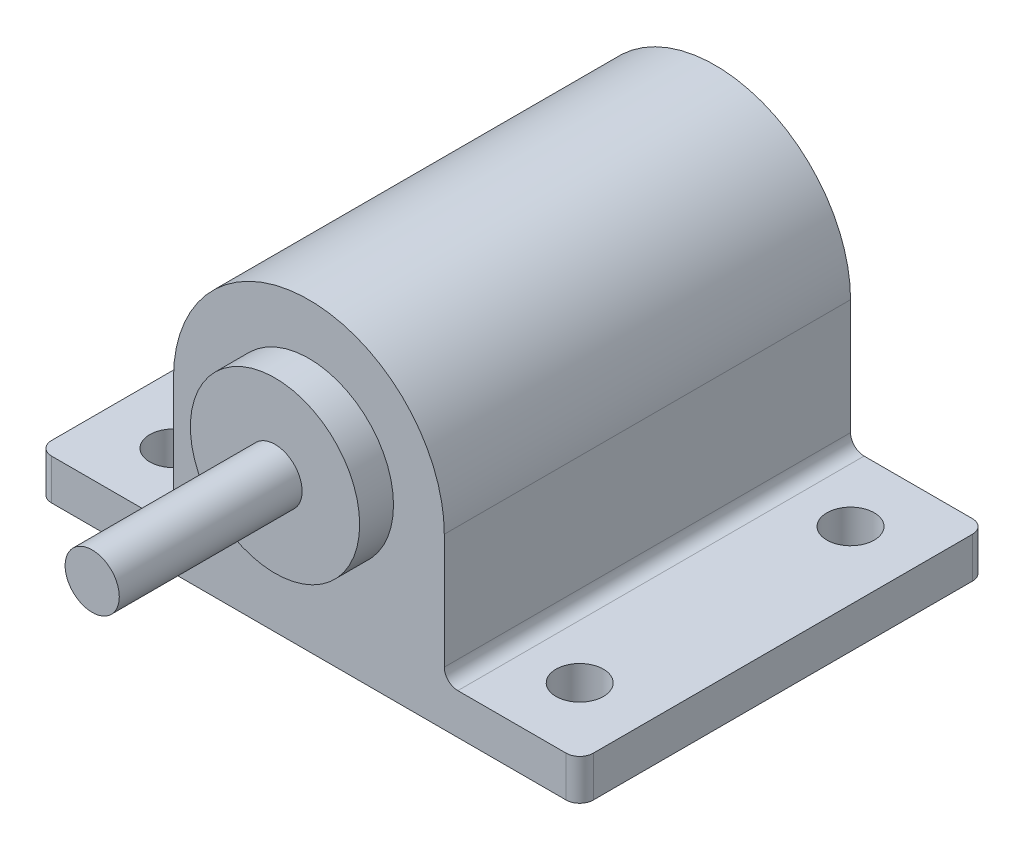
from build123d import *

# Parameters (mm, degrees)
SKETCH_3_R           = 20
EXTRUDE_1_DEPTH      = 30
SKETCH_4_R           = 12.5
EXTRUDE_2_DEPTH      = 5
SKETCH_5_R           = 4
EXTRUDE_3_DEPTH      = 32
SKETCH_6_W           = 80
SKETCH_6_H           = 60
EXTRUDE_4_DEPTH      = 6
EXTRUDE_5_REACH      = 88.423
EXTRUDE_5_END_RADIUS = 20
SKETCH_7_W           = 40
SKETCH_7_H           = 60
SKETCH_8_R           = 3.5
CUT_EXTRUDE_1_DEPTH  = 87.423376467
FILLET_1_R           = 2
FILLET_2_R           = 2


with BuildPart() as part:
    # Sketch 3 → Extrude 1 (new, symmetric)
    with BuildSketch(Plane.XY):
        with Locations((0, 25)):
            Circle(SKETCH_3_R)
    extrude(amount=EXTRUDE_1_DEPTH, both=True)

    # Sketch 4 → Extrude 2 (add)
    with BuildSketch(Plane.XY.offset(30)):
        with Locations((0, 25)):
            Circle(SKETCH_4_R)
    extrude(amount=EXTRUDE_2_DEPTH)

    # Sketch 5 → Extrude 3 (add)
    with BuildSketch(Plane.XY.offset(30)):
        with Locations((0, 25)):
            Circle(SKETCH_5_R)
    extrude(amount=EXTRUDE_3_DEPTH)

    # Sketch 6 → Extrude 4 (add)
    with BuildSketch(Plane(origin=(0, 0, 0), x_dir=(1, 0, 0), z_dir=(0, 1, 0))):
        Rectangle(SKETCH_6_W, SKETCH_6_H)
    extrude(amount=EXTRUDE_4_DEPTH)

    # Extrude 5: up to this cylinder (the profile starts outside it)
    extrude_5_end = Plane(origin=(0, 25, 0), z_dir=(0, 0, -1)) * Cylinder(EXTRUDE_5_END_RADIUS, 217.846, mode=Mode.PRIVATE)
    # Sketch 7 → Extrude 5 (add, up to the surface)
    with BuildSketch(Plane(origin=(0, 0, 0), x_dir=(1, 0, 0), z_dir=(0, 1, 0)), mode=Mode.PRIVATE) as extrude_5_sk1:
        Rectangle(SKETCH_7_W, SKETCH_7_H)
    extrude_5_tool1 = extrude(extrude_5_sk1.sketch, amount=EXTRUDE_5_REACH, mode=Mode.PRIVATE) - extrude_5_end
    add(extrude_5_tool1.solids().sort_by_distance((0, 0, 0))[0])

    # Sketch 8 → Cut-Extrude 1 (cut, through all)
    with BuildSketch(Plane(origin=(0, 0, 0), x_dir=(1, 0, 0), z_dir=(0, 1, 0))):
        with Locations(Location((-30, -20, 0), (0, 0, 270))):
            Circle(SKETCH_8_R)
        with Locations(Location((30, -20, 0), (0, 0, 270))):
            Circle(SKETCH_8_R)
        with Locations(Location((30, 20, 0), (0, 0, 270))):
            Circle(SKETCH_8_R)
        with Locations(Location((-30, 20, 0), (0, 0, 270))):
            Circle(SKETCH_8_R)
    extrude(amount=CUT_EXTRUDE_1_DEPTH, mode=Mode.SUBTRACT)

    # Fillet 1
    fillet_1_edges = [part.edges().sort_by_distance(p)[0] for p in [
        (-20, 6, 0),
        (20, 6, 0),
    ]]
    fillet(fillet_1_edges, radius=FILLET_1_R)

    # Fillet 2
    fillet_2_edges = [part.edges().sort_by_distance(p)[0] for p in [
        (-40, 3, 30),
        (40, 3, -30),
        (-40, 3, -30),
        (40, 3, 30),
    ]]
    fillet(fillet_2_edges, radius=FILLET_2_R)


solid = part.part
